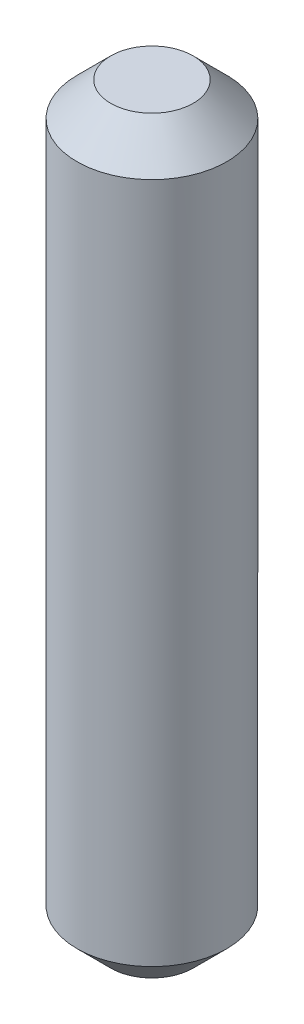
ISO-10303-21;
HEADER;
FILE_DESCRIPTION(('STEP AP214'),'2;1');
FILE_NAME('part.step','',(''),(''),'','','');
FILE_SCHEMA(('AUTOMOTIVE_DESIGN { 1 0 10303 214 1 1 1 1 }'));
ENDSEC;
DATA;
#1=APPLICATION_CONTEXT('core data for automotive mechanical design processes');
#2=APPLICATION_PROTOCOL_DEFINITION('international standard','automotive_design',2000,#1);
#3=PRODUCT_CONTEXT('',#1,'mechanical');
#4=PRODUCT('Part','Part','',(#3));
#5=PRODUCT_RELATED_PRODUCT_CATEGORY('part','',(#4));
#6=PRODUCT_DEFINITION_FORMATION('','',#4);
#7=PRODUCT_DEFINITION_CONTEXT('part definition',#1,'design');
#8=PRODUCT_DEFINITION('design','',#6,#7);
#9=PRODUCT_DEFINITION_SHAPE('','',#8);
#10=(LENGTH_UNIT() NAMED_UNIT(*) SI_UNIT(.MILLI.,.METRE.));
#11=(NAMED_UNIT(*) PLANE_ANGLE_UNIT() SI_UNIT($,.RADIAN.));
#12=(NAMED_UNIT(*) SI_UNIT($,.STERADIAN.) SOLID_ANGLE_UNIT());
#13=UNCERTAINTY_MEASURE_WITH_UNIT(LENGTH_MEASURE(1.E-05),#10,'distance_accuracy_value','');
#14=(GEOMETRIC_REPRESENTATION_CONTEXT(3) GLOBAL_UNCERTAINTY_ASSIGNED_CONTEXT((#13)) GLOBAL_UNIT_ASSIGNED_CONTEXT((#10,
#11,#12)) REPRESENTATION_CONTEXT('',''));
#15=CARTESIAN_POINT('',(0.,0.,0.));
#16=DIRECTION('',(0.,0.,1.));
#17=DIRECTION('',(1.,0.,0.));
#18=AXIS2_PLACEMENT_3D('',#15,#16,#17);
#19=CARTESIAN_POINT('',(-1.,5.,0.));
#20=DIRECTION('',(0.,1.,0.));
#21=DIRECTION('',(-1.,0.,0.));
#22=AXIS2_PLACEMENT_3D('',#19,#20,#21);
#23=PLANE('',#22);
#24=CARTESIAN_POINT('',(0.,5.,0.));
#25=DIRECTION('',(0.,1.,0.));
#26=DIRECTION('',(-1.,0.,0.));
#27=AXIS2_PLACEMENT_3D('',#24,#25,#26);
#28=CIRCLE('',#27,0.550000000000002);
#29=CARTESIAN_POINT('',(-0.550000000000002,5.,0.));
#30=VERTEX_POINT('',#29);
#31=EDGE_CURVE('E50',#30,#30,#28,.T.);
#32=ORIENTED_EDGE('',*,*,#31,.T.);
#33=EDGE_LOOP('',(#32));
#34=FACE_BOUND('',#33,.T.);
#35=ADVANCED_FACE('F35',(#34),#23,.T.);
#36=CARTESIAN_POINT('',(-1.,-5.,0.));
#37=DIRECTION('',(0.,-1.,0.));
#38=DIRECTION('',(1.,0.,0.));
#39=AXIS2_PLACEMENT_3D('',#36,#37,#38);
#40=PLANE('',#39);
#41=CARTESIAN_POINT('',(0.,-5.,0.));
#42=DIRECTION('',(0.,-1.,0.));
#43=DIRECTION('',(1.,0.,0.));
#44=AXIS2_PLACEMENT_3D('',#41,#42,#43);
#45=CIRCLE('',#44,0.549999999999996);
#46=CARTESIAN_POINT('',(0.549999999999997,-5.,0.));
#47=VERTEX_POINT('',#46);
#48=EDGE_CURVE('E10',#47,#47,#45,.T.);
#49=ORIENTED_EDGE('',*,*,#48,.T.);
#50=EDGE_LOOP('',(#49));
#51=FACE_BOUND('',#50,.T.);
#52=ADVANCED_FACE('F66',(#51),#40,.T.);
#53=CARTESIAN_POINT('',(0.,5.,0.));
#54=DIRECTION('',(0.,1.,0.));
#55=DIRECTION('',(-1.,0.,0.));
#56=AXIS2_PLACEMENT_3D('',#53,#54,#55);
#57=CYLINDRICAL_SURFACE('',#56,1.);
#58=CARTESIAN_POINT('',(0.,4.55,0.));
#59=DIRECTION('',(0.,1.,0.));
#60=DIRECTION('',(-1.,0.,0.));
#61=AXIS2_PLACEMENT_3D('',#58,#59,#60);
#62=CIRCLE('',#61,1.);
#63=CARTESIAN_POINT('',(-1.,4.55,0.));
#64=VERTEX_POINT('',#63);
#65=EDGE_CURVE('E42',#64,#64,#62,.F.);
#66=ORIENTED_EDGE('',*,*,#65,.T.);
#67=EDGE_LOOP('',(#66));
#68=FACE_BOUND('',#67,.T.);
#69=CARTESIAN_POINT('',(0.,-4.55,0.));
#70=DIRECTION('',(0.,-1.,0.));
#71=DIRECTION('',(1.,0.,0.));
#72=AXIS2_PLACEMENT_3D('',#69,#70,#71);
#73=CIRCLE('',#72,1.);
#74=CARTESIAN_POINT('',(1.,-4.55,0.));
#75=VERTEX_POINT('',#74);
#76=EDGE_CURVE('E46',#75,#75,#73,.F.);
#77=ORIENTED_EDGE('',*,*,#76,.T.);
#78=EDGE_LOOP('',(#77));
#79=FACE_BOUND('',#78,.T.);
#80=ADVANCED_FACE('F59',(#68,#79),#57,.T.);
#81=CARTESIAN_POINT('',(0.,5.,0.));
#82=DIRECTION('',(0.,-1.,0.));
#83=DIRECTION('',(1.,0.,0.));
#84=AXIS2_PLACEMENT_3D('',#81,#82,#83);
#85=CONICAL_SURFACE('',#84,0.550000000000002,0.785398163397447);
#86=ORIENTED_EDGE('',*,*,#65,.F.);
#87=EDGE_LOOP('',(#86));
#88=FACE_BOUND('',#87,.T.);
#89=ORIENTED_EDGE('',*,*,#31,.F.);
#90=EDGE_LOOP('',(#89));
#91=FACE_BOUND('',#90,.T.);
#92=ADVANCED_FACE('F57',(#88,#91),#85,.T.);
#93=CARTESIAN_POINT('',(0.,-4.55,0.));
#94=DIRECTION('',(0.,1.,0.));
#95=DIRECTION('',(-1.,0.,0.));
#96=AXIS2_PLACEMENT_3D('',#93,#94,#95);
#97=CONICAL_SURFACE('',#96,1.,0.785398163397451);
#98=ORIENTED_EDGE('',*,*,#48,.F.);
#99=EDGE_LOOP('',(#98));
#100=FACE_BOUND('',#99,.T.);
#101=ORIENTED_EDGE('',*,*,#76,.F.);
#102=EDGE_LOOP('',(#101));
#103=FACE_BOUND('',#102,.T.);
#104=ADVANCED_FACE('F37',(#100,#103),#97,.T.);
#105=CLOSED_SHELL('',(#35,#52,#80,#92,#104));
#106=MANIFOLD_SOLID_BREP('B2',#105);
#107=ADVANCED_BREP_SHAPE_REPRESENTATION('',(#18,#106),#14);
#108=SHAPE_DEFINITION_REPRESENTATION(#9,#107);
ENDSEC;
END-ISO-10303-21;
